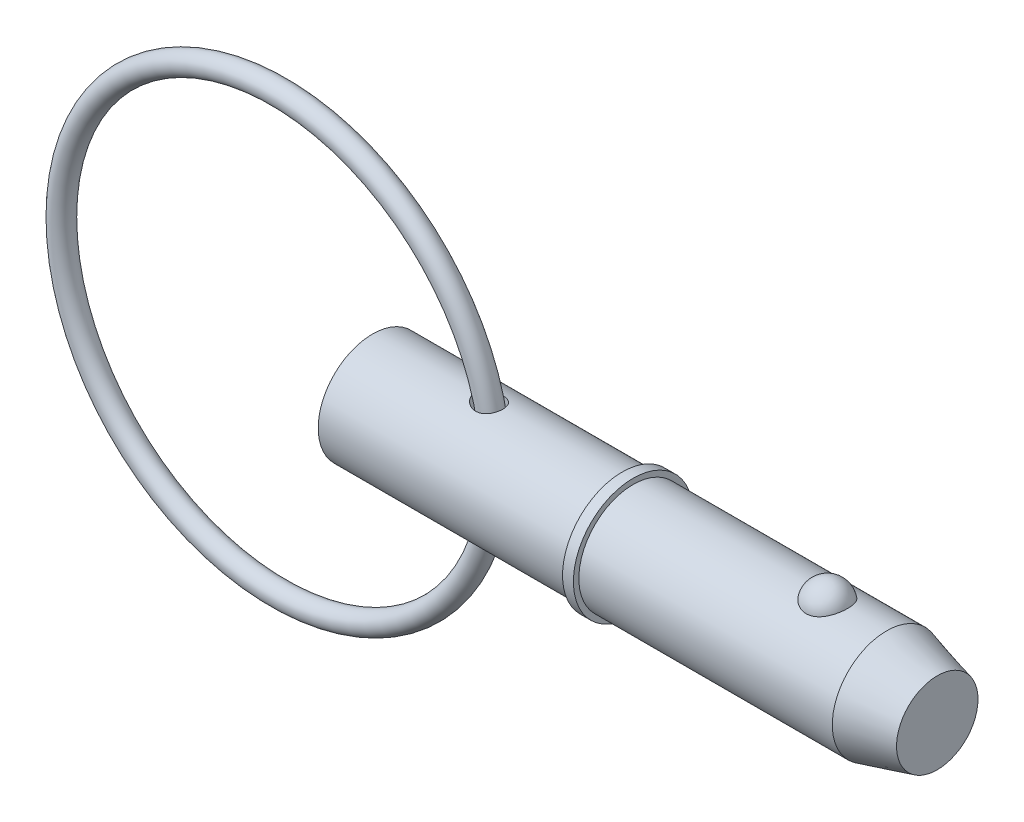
ISO-10303-21;
HEADER;
FILE_DESCRIPTION(('STEP AP214'),'2;1');
FILE_NAME('part.step','',(''),(''),'','','');
FILE_SCHEMA(('AUTOMOTIVE_DESIGN { 1 0 10303 214 1 1 1 1 }'));
ENDSEC;
DATA;
#1=APPLICATION_CONTEXT('core data for automotive mechanical design processes');
#2=APPLICATION_PROTOCOL_DEFINITION('international standard','automotive_design',2000,#1);
#3=PRODUCT_CONTEXT('',#1,'mechanical');
#4=PRODUCT('Part','Part','',(#3));
#5=PRODUCT_RELATED_PRODUCT_CATEGORY('part','',(#4));
#6=PRODUCT_DEFINITION_FORMATION('','',#4);
#7=PRODUCT_DEFINITION_CONTEXT('part definition',#1,'design');
#8=PRODUCT_DEFINITION('design','',#6,#7);
#9=PRODUCT_DEFINITION_SHAPE('','',#8);
#10=(LENGTH_UNIT() NAMED_UNIT(*) SI_UNIT(.MILLI.,.METRE.));
#11=(NAMED_UNIT(*) PLANE_ANGLE_UNIT() SI_UNIT($,.RADIAN.));
#12=(NAMED_UNIT(*) SI_UNIT($,.STERADIAN.) SOLID_ANGLE_UNIT());
#13=UNCERTAINTY_MEASURE_WITH_UNIT(LENGTH_MEASURE(1.E-05),#10,'distance_accuracy_value','');
#14=(GEOMETRIC_REPRESENTATION_CONTEXT(3) GLOBAL_UNCERTAINTY_ASSIGNED_CONTEXT((#13)) GLOBAL_UNIT_ASSIGNED_CONTEXT((#10,
#11,#12)) REPRESENTATION_CONTEXT('',''));
#15=CARTESIAN_POINT('',(0.,0.,0.));
#16=DIRECTION('',(0.,0.,1.));
#17=DIRECTION('',(1.,0.,0.));
#18=AXIS2_PLACEMENT_3D('',#15,#16,#17);
#19=CARTESIAN_POINT('',(-6.86864682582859,0.,0.));
#20=DIRECTION('',(0.,0.,1.));
#21=DIRECTION('',(1.,0.,0.));
#22=AXIS2_PLACEMENT_3D('',#19,#20,#21);
#23=TOROIDAL_SURFACE('',#22,15.875,0.794);
#24=CARTESIAN_POINT('',(9.80035317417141,0.,0.));
#25=VERTEX_POINT('',#24);
#26=VERTEX_LOOP('',#25);
#27=FACE_BOUND('',#26,.T.);
#28=ADVANCED_FACE('P0_F12',(#27),#23,.T.);
#29=CLOSED_SHELL('',(#28));
#30=MANIFOLD_SOLID_BREP('P0_B1',#29);
#31=CARTESIAN_POINT('',(0.,0.,0.));
#32=DIRECTION('',(1.,0.,0.));
#33=DIRECTION('',(0.,0.,-1.));
#34=AXIS2_PLACEMENT_3D('',#31,#32,#33);
#35=CYLINDRICAL_SURFACE('',#34,3.97);
#36=CARTESIAN_POINT('',(7.49679817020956,3.96502331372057,-0.198721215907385));
#37=CARTESIAN_POINT('',(7.50881508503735,3.96235594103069,-0.251916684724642));
#38=CARTESIAN_POINT('',(7.52561550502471,3.95866151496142,-0.304017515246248));
#39=CARTESIAN_POINT('',(7.56786984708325,3.9496659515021,-0.40447153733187));
#40=CARTESIAN_POINT('',(7.59333797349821,3.94436217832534,-0.452818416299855));
#41=CARTESIAN_POINT('',(7.65162192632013,3.93277091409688,-0.544364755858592));
#42=CARTESIAN_POINT('',(7.68440149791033,3.92648832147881,-0.587588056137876));
#43=CARTESIAN_POINT('',(7.75622109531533,3.91354812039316,-0.668369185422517));
#44=CARTESIAN_POINT('',(7.79526077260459,3.90689053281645,-0.705927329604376));
#45=CARTESIAN_POINT('',(7.88192852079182,3.8932854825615,-0.777603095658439));
#46=CARTESIAN_POINT('',(7.92999678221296,3.88635845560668,-0.811192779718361));
#47=CARTESIAN_POINT('',(8.03094744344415,3.87352417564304,-0.870420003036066));
#48=CARTESIAN_POINT('',(8.08383192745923,3.86761736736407,-0.896054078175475));
#49=CARTESIAN_POINT('',(8.19632733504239,3.85719062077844,-0.939958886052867));
#50=CARTESIAN_POINT('',(8.25615064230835,3.85277154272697,-0.957713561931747));
#51=CARTESIAN_POINT('',(8.37807849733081,3.84644428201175,-0.982821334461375));
#52=CARTESIAN_POINT('',(8.44018249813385,3.84453550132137,-0.990176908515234));
#53=CARTESIAN_POINT('',(8.56256649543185,3.84359535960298,-0.993820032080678));
#54=CARTESIAN_POINT('',(8.62283390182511,3.84446524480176,-0.990487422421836));
#55=CARTESIAN_POINT('',(8.74175397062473,3.84884648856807,-0.973323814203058));
#56=CARTESIAN_POINT('',(8.8004073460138,3.85235666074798,-0.959497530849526));
#57=CARTESIAN_POINT('',(8.91034168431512,3.86130428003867,-0.922798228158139));
#58=CARTESIAN_POINT('',(8.96185380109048,3.86659969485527,-0.900580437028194));
#59=CARTESIAN_POINT('',(9.06016940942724,3.87853590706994,-0.847697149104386));
#60=CARTESIAN_POINT('',(9.10697344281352,3.88517654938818,-0.817032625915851));
#61=CARTESIAN_POINT('',(9.19340982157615,3.89885483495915,-0.748999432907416));
#62=CARTESIAN_POINT('',(9.23319345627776,3.90587821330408,-0.711819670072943));
#63=CARTESIAN_POINT('',(9.30598310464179,3.91969783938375,-0.631295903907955));
#64=CARTESIAN_POINT('',(9.33898892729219,3.92649408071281,-0.587951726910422));
#65=CARTESIAN_POINT('',(9.39769437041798,3.939185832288,-0.495874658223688));
#66=CARTESIAN_POINT('',(9.42332322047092,3.94507238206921,-0.447095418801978));
#67=CARTESIAN_POINT('',(9.46625710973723,3.9552342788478,-0.345845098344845));
#68=CARTESIAN_POINT('',(9.48356178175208,3.95950955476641,-0.293373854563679));
#69=CARTESIAN_POINT('',(9.50956700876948,3.96602451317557,-0.185698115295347));
#70=CARTESIAN_POINT('',(9.51818595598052,3.96824487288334,-0.13047272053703));
#71=CARTESIAN_POINT('',(9.52633336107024,3.97034220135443,-0.0193113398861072));
#72=CARTESIAN_POINT('',(9.52586171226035,3.97021914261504,0.0366246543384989));
#73=CARTESIAN_POINT('',(9.51583327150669,3.9676413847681,0.147685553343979));
#74=CARTESIAN_POINT('',(9.50626624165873,3.96518405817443,0.202809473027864));
#75=CARTESIAN_POINT('',(9.47825604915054,3.95819854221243,0.310618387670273));
#76=CARTESIAN_POINT('',(9.45981267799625,3.95367030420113,0.36330332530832));
#77=CARTESIAN_POINT('',(9.41448405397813,3.94303435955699,0.464739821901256));
#78=CARTESIAN_POINT('',(9.38759833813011,3.93692656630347,0.51349116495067));
#79=CARTESIAN_POINT('',(9.32603556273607,3.92380455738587,0.605663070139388));
#80=CARTESIAN_POINT('',(9.29135869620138,3.91679036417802,0.649083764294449));
#81=CARTESIAN_POINT('',(9.21526329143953,3.90267522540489,0.729160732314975));
#82=CARTESIAN_POINT('',(9.17387556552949,3.89557480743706,0.765846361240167));
#83=CARTESIAN_POINT('',(9.08536362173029,3.88206315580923,0.831635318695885));
#84=CARTESIAN_POINT('',(9.03824022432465,3.8756518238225,0.860739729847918));
#85=CARTESIAN_POINT('',(8.94022154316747,3.86431915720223,0.910262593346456));
#86=CARTESIAN_POINT('',(8.88938101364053,3.85938013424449,0.930785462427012));
#87=CARTESIAN_POINT('',(8.78488780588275,3.85141510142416,0.96321476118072));
#88=CARTESIAN_POINT('',(8.73123520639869,3.84838903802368,0.975121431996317));
#89=CARTESIAN_POINT('',(8.62249427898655,3.84453017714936,0.990226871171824));
#90=CARTESIAN_POINT('',(8.56740225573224,3.84370373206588,0.993400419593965));
#91=CARTESIAN_POINT('',(8.45741104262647,3.8442816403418,0.991160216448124));
#92=CARTESIAN_POINT('',(8.40251189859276,3.84568649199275,0.98574454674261));
#93=CARTESIAN_POINT('',(8.29176880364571,3.85062289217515,0.966285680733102));
#94=CARTESIAN_POINT('',(8.23599684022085,3.85424894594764,0.951858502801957));
#95=CARTESIAN_POINT('',(8.12747212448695,3.86325492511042,0.91461785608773));
#96=CARTESIAN_POINT('',(8.0747205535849,3.86863553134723,0.891801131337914));
#97=CARTESIAN_POINT('',(7.97015235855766,3.88095261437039,0.836633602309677));
#98=CARTESIAN_POINT('',(7.91862083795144,3.88796764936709,0.803758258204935));
#99=CARTESIAN_POINT('',(7.82179253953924,3.90250904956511,0.729888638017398));
#100=CARTESIAN_POINT('',(7.77649765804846,3.91003556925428,0.688891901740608));
#101=CARTESIAN_POINT('',(7.69332536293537,3.92478114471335,0.599225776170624));
#102=CARTESIAN_POINT('',(7.6555122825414,3.93199714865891,0.550495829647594));
#103=CARTESIAN_POINT('',(7.5894819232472,3.94512912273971,0.446741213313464));
#104=CARTESIAN_POINT('',(7.56125849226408,3.95104592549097,0.391720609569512));
#105=CARTESIAN_POINT('',(7.51806227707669,3.9603062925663,0.282172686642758));
#106=CARTESIAN_POINT('',(7.50213211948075,3.96383230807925,0.228039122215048));
#107=CARTESIAN_POINT('',(7.48057398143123,3.96863642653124,0.117706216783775));
#108=CARTESIAN_POINT('',(7.47492746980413,3.96991857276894,0.0615107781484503));
#109=CARTESIAN_POINT('',(7.47437932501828,3.97004395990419,-0.0289758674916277));
#110=CARTESIAN_POINT('',(7.47615129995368,3.96964216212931,-0.0632805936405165));
#111=CARTESIAN_POINT('',(7.48358566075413,3.96796978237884,-0.131441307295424));
#112=CARTESIAN_POINT('',(7.48924767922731,3.96669928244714,-0.165297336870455));
#113=CARTESIAN_POINT('',(7.49679817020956,3.96502331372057,-0.198721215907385));
#114=B_SPLINE_CURVE_WITH_KNOTS('',3,(#36,#37,#38,#39,#40,#41,#42,#43,#44,#45,#46,#47,#48,#49,
#50,#51,#52,#53,#54,#55,#56,#57,#58,#59,#60,#61,#62,#63,#64,#65,#66,#67,#68,#69,#70,#71,#72,#73,
#74,#75,#76,#77,#78,#79,#80,#81,#82,#83,#84,#85,#86,#87,#88,#89,#90,#91,#92,#93,#94,#95,#96,#97,
#98,#99,#100,#101,#102,#103,#104,#105,#106,#107,#108,#109,#110,#111,#112,#113),.UNSPECIFIED.,
.T.,.F.,(4,2,2,2,2,2,2,2,2,2,2,2,2,2,2,2,2,2,2,2,2,2,2,2,2,2,2,2,2,2,2,2,2,2,2,2,2,2,4),(0.,
0.163661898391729,0.327593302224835,0.490729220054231,0.653856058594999,0.830244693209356,
1.00671002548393,1.1934572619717,1.38016000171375,1.56030212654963,1.74036335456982,
1.90857505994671,2.07676738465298,2.24071128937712,2.40465981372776,2.57013239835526,
2.73561228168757,2.90263284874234,3.06965537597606,3.23686612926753,3.40408081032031,
3.5713046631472,3.73852437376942,3.90499698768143,4.07144581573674,4.2358058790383,
4.40016134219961,4.56499094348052,4.72985735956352,4.90227873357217,5.0747670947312,
5.25849939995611,5.44228744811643,5.62759301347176,5.81277947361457,5.98144776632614,
6.14981181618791,6.25265388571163,6.35548624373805),.UNSPECIFIED.);
#115=CARTESIAN_POINT('',(7.49679817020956,3.96502331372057,-0.198721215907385));
#116=VERTEX_POINT('',#115);
#117=EDGE_CURVE('P1_E42',#116,#116,#114,.T.);
#118=ORIENTED_EDGE('',*,*,#117,.T.);
#119=EDGE_LOOP('',(#118));
#120=FACE_BOUND('',#119,.T.);
#121=CARTESIAN_POINT('',(0.,0.,0.));
#122=DIRECTION('',(1.,0.,0.));
#123=DIRECTION('',(0.,0.,-1.));
#124=AXIS2_PLACEMENT_3D('',#121,#122,#123);
#125=CIRCLE('',#124,3.97);
#126=CARTESIAN_POINT('',(0.,0.,-3.97));
#127=VERTEX_POINT('',#126);
#128=EDGE_CURVE('P1_E9',#127,#127,#125,.T.);
#129=ORIENTED_EDGE('',*,*,#128,.T.);
#130=EDGE_LOOP('',(#129));
#131=FACE_BOUND('',#130,.T.);
#132=CARTESIAN_POINT('',(18.256,0.,0.));
#133=DIRECTION('',(1.,0.,0.));
#134=DIRECTION('',(0.,0.,-1.));
#135=AXIS2_PLACEMENT_3D('',#132,#133,#134);
#136=CIRCLE('',#135,3.97);
#137=CARTESIAN_POINT('',(18.256,0.,-3.97));
#138=VERTEX_POINT('',#137);
#139=EDGE_CURVE('P1_E25',#138,#138,#136,.T.);
#140=ORIENTED_EDGE('',*,*,#139,.F.);
#141=EDGE_LOOP('',(#140));
#142=FACE_BOUND('',#141,.T.);
#143=CARTESIAN_POINT('',(7.49679817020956,-3.96502331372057,-0.198721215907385));
#144=CARTESIAN_POINT('',(7.48580986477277,-3.96746179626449,-0.150065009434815));
#145=CARTESIAN_POINT('',(7.47881617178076,-3.96904213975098,-0.100459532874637));
#146=CARTESIAN_POINT('',(7.47318383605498,-3.97031279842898,-0.000748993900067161));
#147=CARTESIAN_POINT('',(7.47454464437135,-3.97000323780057,0.049356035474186));
#148=CARTESIAN_POINT('',(7.48554252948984,-3.9675299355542,0.148550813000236));
#149=CARTESIAN_POINT('',(7.49517270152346,-3.9653677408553,0.197641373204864));
#150=CARTESIAN_POINT('',(7.5222068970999,-3.95942609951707,0.293523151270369));
#151=CARTESIAN_POINT('',(7.53961293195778,-3.9556462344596,0.340313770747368));
#152=CARTESIAN_POINT('',(7.58186218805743,-3.946757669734,0.431446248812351));
#153=CARTESIAN_POINT('',(7.6068526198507,-3.94162295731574,0.475716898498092));
#154=CARTESIAN_POINT('',(7.66318857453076,-3.93055115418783,0.559886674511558));
#155=CARTESIAN_POINT('',(7.69453617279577,-3.92461380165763,0.599784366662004));
#156=CARTESIAN_POINT('',(7.76618955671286,-3.91181958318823,0.678467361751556));
#157=CARTESIAN_POINT('',(7.80708710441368,-3.90493119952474,0.716708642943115));
#158=CARTESIAN_POINT('',(7.89431870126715,-3.89148185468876,0.786469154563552));
#159=CARTESIAN_POINT('',(7.94065563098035,-3.88492106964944,0.817984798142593));
#160=CARTESIAN_POINT('',(8.04208221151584,-3.87221514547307,0.876253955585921));
#161=CARTESIAN_POINT('',(8.09758465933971,-3.8661622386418,0.902312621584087));
#162=CARTESIAN_POINT('',(8.21228401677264,-3.855952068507,0.944996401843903));
#163=CARTESIAN_POINT('',(8.27148128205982,-3.85179498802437,0.961620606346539));
#164=CARTESIAN_POINT('',(8.39228716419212,-3.84593851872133,0.984786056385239));
#165=CARTESIAN_POINT('',(8.45390693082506,-3.84425231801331,0.991273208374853));
#166=CARTESIAN_POINT('',(8.57734686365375,-3.84370168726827,0.993408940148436));
#167=CARTESIAN_POINT('',(8.63916691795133,-3.84483588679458,0.989062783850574));
#168=CARTESIAN_POINT('',(8.75703619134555,-3.84970227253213,0.969937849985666));
#169=CARTESIAN_POINT('',(8.81320274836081,-3.85326512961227,0.955838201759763));
#170=CARTESIAN_POINT('',(8.92207486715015,-3.8624204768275,0.918140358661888));
#171=CARTESIAN_POINT('',(8.97478130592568,-3.86801245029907,0.89454458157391));
#172=CARTESIAN_POINT('',(9.07264210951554,-3.88024902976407,0.83982747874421));
#173=CARTESIAN_POINT('',(9.11803751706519,-3.88683023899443,0.809121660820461));
#174=CARTESIAN_POINT('',(9.20292513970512,-3.90048324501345,0.740506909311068));
#175=CARTESIAN_POINT('',(9.24241747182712,-3.90755503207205,0.702598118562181));
#176=CARTESIAN_POINT('',(9.31440361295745,-3.92139192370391,0.620727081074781));
#177=CARTESIAN_POINT('',(9.34691105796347,-3.9281576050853,0.576776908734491));
#178=CARTESIAN_POINT('',(9.40424150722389,-3.94066521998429,0.483990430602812));
#179=CARTESIAN_POINT('',(9.4290641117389,-3.94640710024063,0.435153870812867));
#180=CARTESIAN_POINT('',(9.47070060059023,-3.95631713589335,0.333318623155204));
#181=CARTESIAN_POINT('',(9.48741220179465,-3.96046506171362,0.280276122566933));
#182=CARTESIAN_POINT('',(9.51197570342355,-3.9666399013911,0.172058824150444));
#183=CARTESIAN_POINT('',(9.5198274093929,-3.96866676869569,0.116883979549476));
#184=CARTESIAN_POINT('',(9.52650209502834,-3.9703865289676,0.00572427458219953));
#185=CARTESIAN_POINT('',(9.52528754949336,-3.97006972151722,-0.0502629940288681));
#186=CARTESIAN_POINT('',(9.51376883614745,-3.96711300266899,-0.161232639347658));
#187=CARTESIAN_POINT('',(9.50346452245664,-3.96447305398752,-0.216214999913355));
#188=CARTESIAN_POINT('',(9.47400716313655,-3.95715440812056,-0.323616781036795));
#189=CARTESIAN_POINT('',(9.45485370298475,-3.95247561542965,-0.376036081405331));
#190=CARTESIAN_POINT('',(9.40815019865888,-3.94158766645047,-0.47682082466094));
#191=CARTESIAN_POINT('',(9.38060003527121,-3.93537848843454,-0.525186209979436));
#192=CARTESIAN_POINT('',(9.31780916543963,-3.92212278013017,-0.616423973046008));
#193=CARTESIAN_POINT('',(9.28257772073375,-3.91507726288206,-0.659302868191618));
#194=CARTESIAN_POINT('',(9.20530256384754,-3.90093459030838,-0.738394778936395));
#195=CARTESIAN_POINT('',(9.16325952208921,-3.8938374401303,-0.774608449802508));
#196=CARTESIAN_POINT('',(9.07394283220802,-3.88046830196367,-0.83901178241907));
#197=CARTESIAN_POINT('',(9.02672460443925,-3.87418889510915,-0.867276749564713));
#198=CARTESIAN_POINT('',(8.92806876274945,-3.86308015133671,-0.915492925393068));
#199=CARTESIAN_POINT('',(8.87663164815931,-3.85825064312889,-0.935445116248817));
#200=CARTESIAN_POINT('',(8.77150354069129,-3.85059630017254,-0.966469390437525));
#201=CARTESIAN_POINT('',(8.71783614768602,-3.84775433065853,-0.977617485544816));
#202=CARTESIAN_POINT('',(8.60934883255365,-3.84426767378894,-0.991239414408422));
#203=CARTESIAN_POINT('',(8.55452877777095,-3.84362324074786,-0.993712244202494));
#204=CARTESIAN_POINT('',(8.4438244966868,-3.84454392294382,-0.990144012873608));
#205=CARTESIAN_POINT('',(8.3879479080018,-3.84616465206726,-0.983888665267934));
#206=CARTESIAN_POINT('',(8.27791058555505,-3.85146784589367,-0.962917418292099));
#207=CARTESIAN_POINT('',(8.22375037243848,-3.85515092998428,-0.948198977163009));
#208=CARTESIAN_POINT('',(8.11503410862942,-3.86443542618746,-0.90964598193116));
#209=CARTESIAN_POINT('',(8.06067129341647,-3.87014379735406,-0.885291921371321));
#210=CARTESIAN_POINT('',(7.95661263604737,-3.88274545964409,-0.828274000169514));
#211=CARTESIAN_POINT('',(7.90691941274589,-3.88963940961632,-0.795605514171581));
#212=CARTESIAN_POINT('',(7.81143608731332,-3.90417480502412,-0.720990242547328));
#213=CARTESIAN_POINT('',(7.76592225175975,-3.9118359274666,-0.678692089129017));
#214=CARTESIAN_POINT('',(7.68309200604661,-3.926691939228,-0.586646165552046));
#215=CARTESIAN_POINT('',(7.6457689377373,-3.93388720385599,-0.536904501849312));
#216=CARTESIAN_POINT('',(7.58649683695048,-3.94577687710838,-0.440118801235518));
#217=CARTESIAN_POINT('',(7.56301593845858,-3.95068841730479,-0.394037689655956));
#218=CARTESIAN_POINT('',(7.52386335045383,-3.95904753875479,-0.298549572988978));
#219=CARTESIAN_POINT('',(7.5081856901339,-3.96249623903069,-0.249145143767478));
#220=CARTESIAN_POINT('',(7.49679817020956,-3.96502331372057,-0.198721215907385));
#221=B_SPLINE_CURVE_WITH_KNOTS('',3,(#143,#144,#145,#146,#147,#148,#149,#150,#151,#152,#153,
#154,#155,#156,#157,#158,#159,#160,#161,#162,#163,#164,#165,#166,#167,#168,#169,#170,#171,#172,
#173,#174,#175,#176,#177,#178,#179,#180,#181,#182,#183,#184,#185,#186,#187,#188,#189,#190,#191,
#192,#193,#194,#195,#196,#197,#198,#199,#200,#201,#202,#203,#204,#205,#206,#207,#208,#209,#210,
#211,#212,#213,#214,#215,#216,#217,#218,#219,#220),.UNSPECIFIED.,.T.,.F.,(4,2,2,2,2,2,2,2,2,2,2,
2,2,2,2,2,2,2,2,2,2,2,2,2,2,2,2,2,2,2,2,2,2,2,2,2,2,2,4),(0.,0.149644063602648,
0.299278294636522,0.448787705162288,0.598335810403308,0.750995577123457,0.903705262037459,
1.07224475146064,1.2408739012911,1.4248565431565,1.60885692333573,1.79383585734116,
1.97872492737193,2.15188813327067,2.32500727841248,2.489818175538,2.65462580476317,
2.81910871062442,2.98360017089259,3.15011526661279,3.31663401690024,3.48384236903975,
3.65105340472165,3.81827227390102,3.98549351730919,4.15251423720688,4.31951852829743,
4.48488279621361,4.65022752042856,4.81412860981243,4.97804866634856,5.14606470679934,
5.31413123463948,5.49286956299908,5.67170754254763,5.85859317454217,6.0453263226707,
6.20052601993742,6.35560677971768),.UNSPECIFIED.);
#222=CARTESIAN_POINT('',(7.49679817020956,-3.96502331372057,-0.198721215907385));
#223=VERTEX_POINT('',#222);
#224=EDGE_CURVE('P1_E17',#223,#223,#221,.T.);
#225=ORIENTED_EDGE('',*,*,#224,.T.);
#226=EDGE_LOOP('',(#225));
#227=FACE_BOUND('',#226,.T.);
#228=ADVANCED_FACE('P1_F13',(#120,#131,#142,#227),#35,.T.);
#229=CARTESIAN_POINT('',(0.,0.,0.));
#230=DIRECTION('',(1.,0.,0.));
#231=DIRECTION('',(0.,0.,-1.));
#232=AXIS2_PLACEMENT_3D('',#229,#230,#231);
#233=CYLINDRICAL_SURFACE('',#232,3.97);
#234=CARTESIAN_POINT('',(37.5759395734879,0.,0.));
#235=DIRECTION('',(1.,0.,0.));
#236=DIRECTION('',(0.,0.,-1.));
#237=AXIS2_PLACEMENT_3D('',#234,#235,#236);
#238=CIRCLE('',#237,3.97);
#239=CARTESIAN_POINT('',(37.5759395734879,0.,-3.97));
#240=VERTEX_POINT('',#239);
#241=EDGE_CURVE('P1_E99',#240,#240,#238,.T.);
#242=ORIENTED_EDGE('',*,*,#241,.F.);
#243=EDGE_LOOP('',(#242));
#244=FACE_BOUND('',#243,.T.);
#245=CARTESIAN_POINT('',(19.05,0.,0.));
#246=DIRECTION('',(1.,0.,0.));
#247=DIRECTION('',(0.,0.,-1.));
#248=AXIS2_PLACEMENT_3D('',#245,#246,#247);
#249=CIRCLE('',#248,3.97);
#250=CARTESIAN_POINT('',(19.05,0.,-3.97));
#251=VERTEX_POINT('',#250);
#252=EDGE_CURVE('P1_E96',#251,#251,#249,.T.);
#253=ORIENTED_EDGE('',*,*,#252,.T.);
#254=EDGE_LOOP('',(#253));
#255=FACE_BOUND('',#254,.T.);
#256=CARTESIAN_POINT('',(33.2451922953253,3.65715365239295,1.5447094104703));
#257=CARTESIAN_POINT('',(33.1652448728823,3.65716001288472,1.54470290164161));
#258=CARTESIAN_POINT('',(33.0851650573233,3.65987074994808,1.53832549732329));
#259=CARTESIAN_POINT('',(32.9272374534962,3.6704221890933,1.51297018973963));
#260=CARTESIAN_POINT('',(32.8493961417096,3.67827646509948,1.49395894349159));
#261=CARTESIAN_POINT('',(32.6984614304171,3.69818848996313,1.4439595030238));
#262=CARTESIAN_POINT('',(32.6253560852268,3.71023513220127,1.41300293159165));
#263=CARTESIAN_POINT('',(32.4855630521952,3.7372183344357,1.34000212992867));
#264=CARTESIAN_POINT('',(32.4188725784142,3.75215363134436,1.29796274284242));
#265=CARTESIAN_POINT('',(32.29148864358,3.78384968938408,1.20248834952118));
#266=CARTESIAN_POINT('',(32.2310299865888,3.80065129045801,1.14875388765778));
#267=CARTESIAN_POINT('',(32.1196942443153,3.83398532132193,1.03205417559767));
#268=CARTESIAN_POINT('',(32.0688200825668,3.85051766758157,0.969086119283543));
#269=CARTESIAN_POINT('',(31.9756321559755,3.88238608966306,0.832526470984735));
#270=CARTESIAN_POINT('',(31.9337961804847,3.89763698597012,0.758588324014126));
#271=CARTESIAN_POINT('',(31.8625108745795,3.92451063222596,0.604352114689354));
#272=CARTESIAN_POINT('',(31.8330623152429,3.93613315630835,0.524053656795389));
#273=CARTESIAN_POINT('',(31.7868927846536,3.95467606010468,0.358403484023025));
#274=CARTESIAN_POINT('',(31.7703127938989,3.96154426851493,0.273006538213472));
#275=CARTESIAN_POINT('',(31.750756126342,3.96967008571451,0.100408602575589));
#276=CARTESIAN_POINT('',(31.7477789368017,3.97092790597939,0.0132076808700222));
#277=CARTESIAN_POINT('',(31.7554587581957,3.96771794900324,-0.159844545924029));
#278=CARTESIAN_POINT('',(31.7660164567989,3.96329187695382,-0.24570105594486));
#279=CARTESIAN_POINT('',(31.8003800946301,3.94923163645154,-0.414277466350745));
#280=CARTESIAN_POINT('',(31.8241862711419,3.93959737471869,-0.496997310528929));
#281=CARTESIAN_POINT('',(31.8846114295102,3.91607752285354,-0.657113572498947));
#282=CARTESIAN_POINT('',(31.9212495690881,3.90218558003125,-0.734501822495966));
#283=CARTESIAN_POINT('',(32.0065935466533,3.87158287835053,-0.881704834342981));
#284=CARTESIAN_POINT('',(32.0553004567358,3.8548718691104,-0.951518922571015));
#285=CARTESIAN_POINT('',(32.1641161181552,3.82028735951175,-1.08208159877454));
#286=CARTESIAN_POINT('',(32.2242955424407,3.80240713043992,-1.14276958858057));
#287=CARTESIAN_POINT('',(32.354493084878,3.76758161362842,-1.25282437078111));
#288=CARTESIAN_POINT('',(32.4245105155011,3.75063626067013,-1.30219195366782));
#289=CARTESIAN_POINT('',(32.57118160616,3.71998948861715,-1.38729709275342));
#290=CARTESIAN_POINT('',(32.6476813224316,3.70623183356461,-1.42327904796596));
#291=CARTESIAN_POINT('',(32.8062981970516,3.68323188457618,-1.48178996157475));
#292=CARTESIAN_POINT('',(32.8884132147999,3.67398788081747,-1.50432401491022));
#293=CARTESIAN_POINT('',(33.0514810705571,3.6615216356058,-1.53440939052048));
#294=CARTESIAN_POINT('',(33.1322840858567,3.65801951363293,-1.54265826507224));
#295=CARTESIAN_POINT('',(33.2942085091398,3.65657341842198,-1.54608423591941));
#296=CARTESIAN_POINT('',(33.3753298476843,3.65862829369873,-1.5412640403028));
#297=CARTESIAN_POINT('',(33.5328122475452,3.66788969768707,-1.51908474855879));
#298=CARTESIAN_POINT('',(33.6092422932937,3.67492621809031,-1.50213925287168));
#299=CARTESIAN_POINT('',(33.7580412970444,3.69318404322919,-1.4566698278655));
#300=CARTESIAN_POINT('',(33.8304099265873,3.7044056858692,-1.42814496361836));
#301=CARTESIAN_POINT('',(33.9708029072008,3.73012749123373,-1.35956319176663));
#302=CARTESIAN_POINT('',(34.0387000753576,3.74469307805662,-1.31927107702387));
#303=CARTESIAN_POINT('',(34.1668649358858,3.77545272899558,-1.22847440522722));
#304=CARTESIAN_POINT('',(34.2271308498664,3.79164717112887,-1.17796747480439));
#305=CARTESIAN_POINT('',(34.3416346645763,3.82490325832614,-1.0651926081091));
#306=CARTESIAN_POINT('',(34.3954137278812,3.84196735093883,-1.0024591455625));
#307=CARTESIAN_POINT('',(34.4920988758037,3.87439863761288,-0.868715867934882));
#308=CARTESIAN_POINT('',(34.5350030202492,3.88976552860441,-0.797704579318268));
#309=CARTESIAN_POINT('',(34.610266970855,3.91771381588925,-0.646896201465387));
#310=CARTESIAN_POINT('',(34.6422532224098,3.93019255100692,-0.566893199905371));
#311=CARTESIAN_POINT('',(34.6931101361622,3.95043886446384,-0.402255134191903));
#312=CARTESIAN_POINT('',(34.7119807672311,3.95820643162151,-0.317620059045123));
#313=CARTESIAN_POINT('',(34.7362162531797,3.96823733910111,-0.14615699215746));
#314=CARTESIAN_POINT('',(34.7415874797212,3.97050327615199,-0.0593300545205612));
#315=CARTESIAN_POINT('',(34.738730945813,3.96930811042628,0.114057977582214));
#316=CARTESIAN_POINT('',(34.7305035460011,3.9658471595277,0.200619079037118));
#317=CARTESIAN_POINT('',(34.7007063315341,3.95358562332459,0.370506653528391));
#318=CARTESIAN_POINT('',(34.6792129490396,3.94481563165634,0.453848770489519));
#319=CARTESIAN_POINT('',(34.6233839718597,3.92284586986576,0.615497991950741));
#320=CARTESIAN_POINT('',(34.5890474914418,3.90964579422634,0.693804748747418));
#321=CARTESIAN_POINT('',(34.5079702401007,3.88006987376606,0.843703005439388));
#322=CARTESIAN_POINT('',(34.4611536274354,3.86367478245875,0.915249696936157));
#323=CARTESIAN_POINT('',(34.3561897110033,3.82949741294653,1.04910810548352));
#324=CARTESIAN_POINT('',(34.2980428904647,3.81171519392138,1.1114202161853));
#325=CARTESIAN_POINT('',(34.1717433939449,3.77673366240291,1.22503948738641));
#326=CARTESIAN_POINT('',(34.1035970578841,3.75953398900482,1.27635357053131));
#327=CARTESIAN_POINT('',(33.9589009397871,3.72770506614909,1.36653336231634));
#328=CARTESIAN_POINT('',(33.882348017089,3.7130767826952,1.4053943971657));
#329=CARTESIAN_POINT('',(33.7257594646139,3.68864287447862,1.46830480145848));
#330=CARTESIAN_POINT('',(33.6459307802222,3.67869017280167,1.49281289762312));
#331=CARTESIAN_POINT('',(33.4829877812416,3.66414535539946,1.52817474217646));
#332=CARTESIAN_POINT('',(33.3998840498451,3.65953723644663,1.53906926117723));
#333=CARTESIAN_POINT('',(33.2927760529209,3.6573894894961,1.54414878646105));
#334=CARTESIAN_POINT('',(33.2689900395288,3.65715175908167,1.54471134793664));
#335=CARTESIAN_POINT('',(33.2451922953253,3.65715365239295,1.5447094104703));
#336=B_SPLINE_CURVE_WITH_KNOTS('',3,(#256,#257,#258,#259,#260,#261,#262,#263,#264,#265,#266,
#267,#268,#269,#270,#271,#272,#273,#274,#275,#276,#277,#278,#279,#280,#281,#282,#283,#284,#285,
#286,#287,#288,#289,#290,#291,#292,#293,#294,#295,#296,#297,#298,#299,#300,#301,#302,#303,#304,
#305,#306,#307,#308,#309,#310,#311,#312,#313,#314,#315,#316,#317,#318,#319,#320,#321,#322,#323,
#324,#325,#326,#327,#328,#329,#330,#331,#332,#333,#334,#335),.UNSPECIFIED.,.T.,.F.,(4,2,2,2,2,2,
2,2,2,2,2,2,2,2,2,2,2,2,2,2,2,2,2,2,2,2,2,2,2,2,2,2,2,2,2,2,2,2,2,4),(0.,0.239777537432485,
0.480190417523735,0.71997117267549,0.959647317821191,1.20639040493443,1.45320863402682,
1.71093679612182,1.9686809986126,2.2292105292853,2.48973023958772,2.74834928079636,
3.00697295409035,3.26598440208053,3.52501886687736,3.78570385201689,4.04637062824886,
4.30201257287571,4.55755760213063,4.80022994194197,5.04285200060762,5.27757006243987,
5.51230707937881,5.75210128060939,5.99195126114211,6.24392810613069,6.49594987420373,
6.75588818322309,7.01582710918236,7.27564332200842,7.53545264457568,7.79377886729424,
8.05212290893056,8.31207418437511,8.57201437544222,8.83179046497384,9.09166393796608,
9.34270057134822,9.59298357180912,9.66435753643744),.UNSPECIFIED.);
#337=CARTESIAN_POINT('',(33.2451922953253,3.65715365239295,1.5447094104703));
#338=VERTEX_POINT('',#337);
#339=EDGE_CURVE('P1_E34',#338,#338,#336,.T.);
#340=ORIENTED_EDGE('',*,*,#339,.T.);
#341=EDGE_LOOP('',(#340));
#342=FACE_BOUND('',#341,.T.);
#343=ADVANCED_FACE('P1_F46',(#244,#255,#342),#233,.T.);
#344=CARTESIAN_POINT('',(0.,0.,0.));
#345=DIRECTION('',(-1.,0.,0.));
#346=DIRECTION('',(0.,0.,1.));
#347=AXIS2_PLACEMENT_3D('',#344,#345,#346);
#348=PLANE('',#347);
#349=ORIENTED_EDGE('',*,*,#128,.F.);
#350=EDGE_LOOP('',(#349));
#351=FACE_BOUND('',#350,.T.);
#352=ADVANCED_FACE('P1_F15',(#351),#348,.T.);
#353=CARTESIAN_POINT('',(18.256,3.97,0.));
#354=DIRECTION('',(-1.,0.,0.));
#355=DIRECTION('',(0.,0.,1.));
#356=AXIS2_PLACEMENT_3D('',#353,#354,#355);
#357=PLANE('',#356);
#358=ORIENTED_EDGE('',*,*,#139,.T.);
#359=EDGE_LOOP('',(#358));
#360=FACE_BOUND('',#359,.T.);
#361=CARTESIAN_POINT('',(18.256,0.,0.));
#362=DIRECTION('',(1.,0.,0.));
#363=DIRECTION('',(0.,0.,-1.));
#364=AXIS2_PLACEMENT_3D('',#361,#362,#363);
#365=CIRCLE('',#364,4.367);
#366=CARTESIAN_POINT('',(18.256,0.,-4.367));
#367=VERTEX_POINT('',#366);
#368=EDGE_CURVE('P1_E30',#367,#367,#365,.T.);
#369=ORIENTED_EDGE('',*,*,#368,.F.);
#370=EDGE_LOOP('',(#369));
#371=FACE_BOUND('',#370,.T.);
#372=ADVANCED_FACE('P1_F81',(#360,#371),#357,.T.);
#373=CARTESIAN_POINT('',(0.,0.,0.));
#374=DIRECTION('',(1.,0.,0.));
#375=DIRECTION('',(0.,0.,-1.));
#376=AXIS2_PLACEMENT_3D('',#373,#374,#375);
#377=CYLINDRICAL_SURFACE('',#376,4.367);
#378=ORIENTED_EDGE('',*,*,#368,.T.);
#379=EDGE_LOOP('',(#378));
#380=FACE_BOUND('',#379,.T.);
#381=CARTESIAN_POINT('',(19.05,0.,0.));
#382=DIRECTION('',(1.,0.,0.));
#383=DIRECTION('',(0.,0.,-1.));
#384=AXIS2_PLACEMENT_3D('',#381,#382,#383);
#385=CIRCLE('',#384,4.367);
#386=CARTESIAN_POINT('',(19.05,0.,-4.367));
#387=VERTEX_POINT('',#386);
#388=EDGE_CURVE('P1_E95',#387,#387,#385,.T.);
#389=ORIENTED_EDGE('',*,*,#388,.F.);
#390=EDGE_LOOP('',(#389));
#391=FACE_BOUND('',#390,.T.);
#392=ADVANCED_FACE('P1_F68',(#380,#391),#377,.T.);
#393=CARTESIAN_POINT('',(19.05,4.367,0.));
#394=DIRECTION('',(1.,0.,0.));
#395=DIRECTION('',(0.,0.,-1.));
#396=AXIS2_PLACEMENT_3D('',#393,#394,#395);
#397=PLANE('',#396);
#398=ORIENTED_EDGE('',*,*,#388,.T.);
#399=EDGE_LOOP('',(#398));
#400=FACE_BOUND('',#399,.T.);
#401=ORIENTED_EDGE('',*,*,#252,.F.);
#402=EDGE_LOOP('',(#401));
#403=FACE_BOUND('',#402,.T.);
#404=ADVANCED_FACE('P1_F62',(#400,#403),#397,.T.);
#405=CARTESIAN_POINT('',(41.28,0.,0.));
#406=DIRECTION('',(-1.,0.,0.));
#407=DIRECTION('',(0.,0.,1.));
#408=AXIS2_PLACEMENT_3D('',#405,#406,#407);
#409=CONICAL_SURFACE('',#408,2.97750000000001,0.26179938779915);
#410=ORIENTED_EDGE('',*,*,#241,.T.);
#411=EDGE_LOOP('',(#410));
#412=FACE_BOUND('',#411,.T.);
#413=CARTESIAN_POINT('',(41.28,0.,0.));
#414=DIRECTION('',(1.,0.,0.));
#415=DIRECTION('',(0.,0.,-1.));
#416=AXIS2_PLACEMENT_3D('',#413,#414,#415);
#417=CIRCLE('',#416,2.97750000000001);
#418=CARTESIAN_POINT('',(41.28,0.,-2.97750000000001));
#419=VERTEX_POINT('',#418);
#420=EDGE_CURVE('P1_E41',#419,#419,#417,.T.);
#421=ORIENTED_EDGE('',*,*,#420,.F.);
#422=EDGE_LOOP('',(#421));
#423=FACE_BOUND('',#422,.T.);
#424=ADVANCED_FACE('P1_F59',(#412,#423),#409,.T.);
#425=CARTESIAN_POINT('',(41.28,2.97750000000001,0.));
#426=DIRECTION('',(1.,0.,0.));
#427=DIRECTION('',(0.,0.,-1.));
#428=AXIS2_PLACEMENT_3D('',#425,#426,#427);
#429=PLANE('',#428);
#430=ORIENTED_EDGE('',*,*,#420,.T.);
#431=EDGE_LOOP('',(#430));
#432=FACE_BOUND('',#431,.T.);
#433=ADVANCED_FACE('P1_F55',(#432),#429,.T.);
#434=CARTESIAN_POINT('',(33.2451922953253,3.57299999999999,0.));
#435=DIRECTION('',(-1.,0.,0.));
#436=DIRECTION('',(0.,1.,0.));
#437=AXIS2_PLACEMENT_3D('',#434,#435,#436);
#438=SPHERICAL_SURFACE('',#437,1.54700000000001);
#439=ORIENTED_EDGE('',*,*,#339,.F.);
#440=EDGE_LOOP('',(#439));
#441=FACE_BOUND('',#440,.T.);
#442=ADVANCED_FACE('P1_F50',(#441),#438,.T.);
#443=CARTESIAN_POINT('',(-6.86864682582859,0.,0.));
#444=DIRECTION('',(0.,0.,1.));
#445=DIRECTION('',(1.,0.,0.));
#446=AXIS2_PLACEMENT_3D('',#443,#444,#445);
#447=TOROIDAL_SURFACE('',#446,15.875,0.992500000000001);
#448=ORIENTED_EDGE('',*,*,#224,.F.);
#449=EDGE_LOOP('',(#448));
#450=FACE_BOUND('',#449,.T.);
#451=ORIENTED_EDGE('',*,*,#117,.F.);
#452=EDGE_LOOP('',(#451));
#453=FACE_BOUND('',#452,.T.);
#454=ADVANCED_FACE('P1_F54',(#450,#453),#447,.F.);
#455=CLOSED_SHELL('',(#228,#343,#352,#372,#392,#404,#424,#433,#442,#454));
#456=MANIFOLD_SOLID_BREP('P1_B1',#455);
#457=ADVANCED_BREP_SHAPE_REPRESENTATION('',(#18,#30,#456),#14);
#458=SHAPE_DEFINITION_REPRESENTATION(#9,#457);
ENDSEC;
END-ISO-10303-21;
